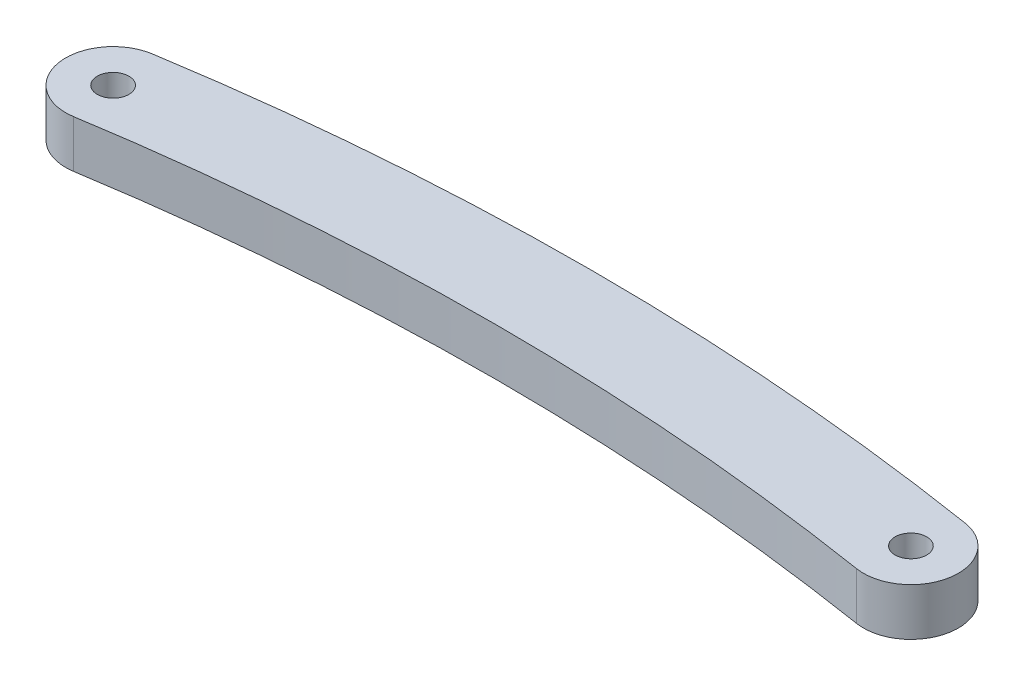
from build123d import *

# Parameters (mm, degrees)
ESQUISSE1_R        = 1
BOSS_EXTRU_1_DEPTH = 3


with BuildPart() as part:
    # Esquisse1 → Boss.-Extru.1 (new body)
    with BuildSketch(Plane(origin=(0, 0, 0), x_dir=(1, 0, 0), z_dir=(0, 1, 0))):
        with BuildLine():
            ThreePointArc((25.69370507, 2.962505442), (0, 5), (-25.69370507, 2.962505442))
            ThreePointArc((-25.69370507, 2.962505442), (-28.183387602, -0.47282291), (-24.74805925, -2.962505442))
            ThreePointArc((-24.74805925, -2.962505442), (0, -1), (24.74805925, -2.962505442))
            ThreePointArc((24.74805925, -2.962505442), (28.183387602, -0.47282291), (25.69370507, 2.962505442))
        make_face()
        with Locations(Location((25.22088216, 0, 0), (0, 0, 270))):
            Circle(ESQUISSE1_R, mode=Mode.SUBTRACT)
        with Locations(Location((-25.22088216, 0, 0), (0, 0, 270))):
            Circle(ESQUISSE1_R, mode=Mode.SUBTRACT)
    extrude(amount=BOSS_EXTRU_1_DEPTH)


solid = part.part
